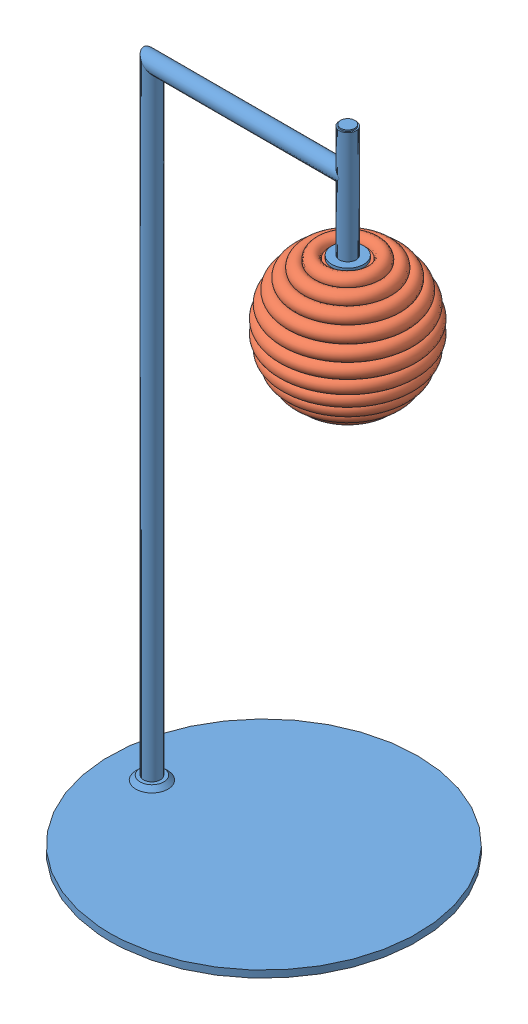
SolidWorks assembly DOUL_S1310.SLDASM, configuration Predeterminado (file format 11000). Lengths in mm.
Overall size (231.78 481 220).
2 component instances, 2 part files, 4 mates.
Components (placement in the parent):
- ESTRUCTURA_SOBREMESA_DOUL_S1310-1: ESTRUCTURA_SOBREMESA_DOUL_S1310.SLDPRT [Predeterminado] at origin size (220 481 220)
- CABEZAL_DOUL_S1310-1: CABEZAL_DOUL_S1310.SLDPRT [Predeterminado] at (60 356 0) x (0.282497 0 -0.959268) z (0.959268 0 0.282497) size (99.51 96.11 99.51)
Mates (geometry in assembly coordinates):
- Concéntrica1: concentric: cylinder of assembly; cylinder of assembly; cylinder of ESTRUCTURA_SOBREMESA_DOUL_S1310-1 through (60 398 0) axis (0 1 0) radius 11.5; cylinder of CABEZAL_DOUL_S1310-1 through (60 388 0) axis (0 1 0) radius 11
- Coincidente1: coincident: plane of assembly; plane of assembly; plane of ESTRUCTURA_SOBREMESA_DOUL_S1310-1 through (60 398 0) normal (0 -1 0); plane of CABEZAL_DOUL_S1310-1 through (60 398 0) normal (0 1 0)
- Concéntrica2: concentric: cylinder of assembly; cylinder of assembly; cylinder of ESTRUCTURA_SOBREMESA_DOUL_S1310-1 through (60 398 0) axis (0 1 0) radius 11.5; cylinder of CABEZAL_DOUL_S1310-1 through (60 388 0) axis (0 1 0) radius 11
- Coincidente2: coincident: plane of assembly; plane of assembly; plane of ESTRUCTURA_SOBREMESA_DOUL_S1310-1 through (60 398 0) normal (0 -1 0); plane of CABEZAL_DOUL_S1310-1 through (60 398 0) normal (0 1 0)
